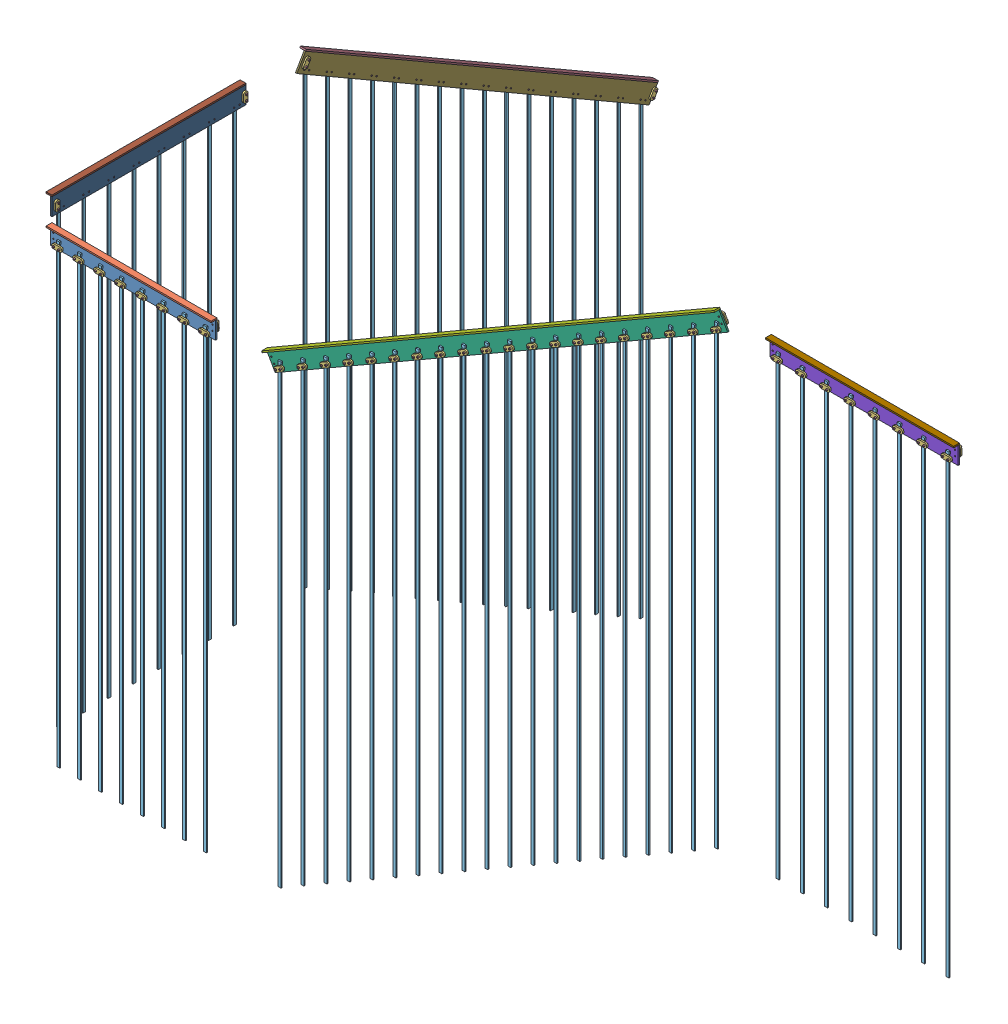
SolidWorks assembly Assem4.sldasm, configuration Default (file format 9000). Lengths in mm.
Overall size (4126.03 4076.18 2805.12).
297 component instances, 13 part files, 0 mates.
Components (placement in the parent):
- fs-ua-tier-assembly-1: fs-ua-tier-assembly.SLDASM [Default] at origin size (3991.35 3206.92 54.02)
  - fs-ua-left-mount-assembly-with-led-strips-1: fs-ua-left-mount-assembly-with-led-strips.SLDASM [Default] at origin size (723.9 2044.33 45.12)
    - fs-ua-left-mount-assembly-with-screws-1: fs-ua-left-mount-assembly-with-screws.SLDASM [Default] at origin size (723.9 82.55 45.12)
      - fs-ua-left-mount-assembly-1: fs-ua-left-mount-assembly.SLDASM [Default] at origin size (723.9 82.55 38.15)
        - fs-ua-left-mount-vertical-component-1: fs-ua-left-mount-vertical-component.SLDPRT [Default] at origin size (723.9 76.2 6.35)
        - fs-ua-left-mount-horizontal-component-1: fs-ua-left-mount-horizontal-component.SLDPRT [Default] at (361.95 76.2 12.7) size (723.9 6.35 25.4)
        - fs-clamp-1: fs-clamp.SLDPRT [Default] at (27.94 15.24 12.7326) size (44.45 20.32 6.35)
        - fs-clamp-2: fs-clamp.SLDPRT [Default] at (12.7 29.845 -12.7409) x (0 1 0) z (0 0 1) size (44.45 20.32 6.35)
        - fs-clamp-3: fs-clamp.SLDPRT [Default] at (711.2 29.845 -6.3972) x (0 1 0) z (0 0 -1) size (44.45 20.32 6.35)
        - fs-clamp-4: fs-clamp.SLDPRT [Default] at (119.9243 15.24 12.7326) size (44.45 20.32 6.35)
        - fs-clamp-5: fs-clamp.SLDPRT [Default] at (211.9086 15.24 12.7326) size (44.45 20.32 6.35)
        - fs-clamp-6: fs-clamp.SLDPRT [Default] at (303.893 15.24 12.7326) size (44.45 20.32 6.35)
        - fs-clamp-7: fs-clamp.SLDPRT [Default] at (395.8773 15.24 12.7326) size (44.45 20.32 6.35)
        - fs-clamp-8: fs-clamp.SLDPRT [Default] at (487.8616 15.24 12.7326) size (44.45 20.32 6.35)
        - fs-clamp-9: fs-clamp.SLDPRT [Default] at (579.8459 15.24 12.7326) size (44.45 20.32 6.35)
        - fs-clamp-10: fs-clamp.SLDPRT [Default] at (671.8303 15.24 12.7326) size (44.45 20.32 6.35)
      - socket head cap screw_ai-1: socket head cap screw_ai.sldprt [HX-SHCS 0.19-32x0.875x0.875-N] at (27.94 15.24 25.0524) x (0 0 -1) z (-0.570283 0.821448 0) size (27.05 7.94 7.94)
      - socket head cap screw_ai-2: socket head cap screw_ai.sldprt [HX-SHCS 0.19-32x0.875x0.875-N] at (711.2 53.975 -19.4006) x (0 0 1) z (-0.954871 -0.29702 0) size (27.05 7.94 7.94)
      - socket head cap screw_ai-3: socket head cap screw_ai.sldprt [HX-SHCS 0.19-32x0.875x0.875-N] at (711.2 29.845 -19.7235) x (0 0 1) z (-0.178736 -0.983897 0) size (27.05 7.94 7.94)
      - socket head cap screw_ai-4: socket head cap screw_ai.sldprt [HX-SHCS 0.19-32x0.875x0.875-N] at (12.7 53.975 -19.387) x (0 0 1) z (0.231262 0.972891 0) size (27.05 7.94 7.94)
      - socket head cap screw_ai-5: socket head cap screw_ai.sldprt [HX-SHCS 0.19-32x0.875x0.875-N] at (12.7 29.845 -19.6757) x (0 0 1) z (-0.841681 -0.539975 0) size (27.05 7.94 7.94)
      - socket head cap screw_ai-6: socket head cap screw_ai.sldprt [HX-SHCS 0.19-32x0.875x0.875-N] at (52.07 15.24 25.3347) x (0 0 -1) z (0.61191 -0.790927 0) size (27.05 7.94 7.94)
      - socket head cap screw_ai-7: socket head cap screw_ai.sldprt [HX-SHCS 0.19-32x0.875x0.875-N] at (119.9251 15.24 25.0524) x (0 0 -1) z (-0.570283 0.821448 0) size (27.05 7.94 7.94)
      - socket head cap screw_ai-8: socket head cap screw_ai.sldprt [HX-SHCS 0.19-32x0.875x0.875-N] at (211.9102 15.24 25.0524) x (0 0 -1) z (-0.570283 0.821448 0) size (27.05 7.94 7.94)
      - socket head cap screw_ai-9: socket head cap screw_ai.sldprt [HX-SHCS 0.19-32x0.875x0.875-N] at (303.8953 15.24 25.0524) x (0 0 -1) z (-0.570283 0.821448 0) size (27.05 7.94 7.94)
      - socket head cap screw_ai-10: socket head cap screw_ai.sldprt [HX-SHCS 0.19-32x0.875x0.875-N] at (395.8803 15.24 25.0524) x (0 0 -1) z (-0.570283 0.821448 0) size (27.05 7.94 7.94)
      - socket head cap screw_ai-11: socket head cap screw_ai.sldprt [HX-SHCS 0.19-32x0.875x0.875-N] at (487.8654 15.24 25.0524) x (0 0 -1) z (-0.570283 0.821448 0) size (27.05 7.94 7.94)
      - socket head cap screw_ai-12: socket head cap screw_ai.sldprt [HX-SHCS 0.19-32x0.875x0.875-N] at (579.8505 15.24 25.0524) x (0 0 -1) z (-0.570283 0.821448 0) size (27.05 7.94 7.94)
      - socket head cap screw_ai-13: socket head cap screw_ai.sldprt [HX-SHCS 0.19-32x0.875x0.875-N] at (671.8356 15.24 25.0524) x (0 0 -1) z (-0.570283 0.821448 0) size (27.05 7.94 7.94)
      - socket head cap screw_ai-14: socket head cap screw_ai.sldprt [HX-SHCS 0.19-32x0.875x0.875-N] at (144.0551 15.24 25.3347) x (0 0 -1) z (0.61191 -0.790927 0) size (27.05 7.94 7.94)
      - socket head cap screw_ai-15: socket head cap screw_ai.sldprt [HX-SHCS 0.19-32x0.875x0.875-N] at (236.0402 15.24 25.3347) x (0 0 -1) z (0.61191 -0.790927 0) size (27.05 7.94 7.94)
      - socket head cap screw_ai-16: socket head cap screw_ai.sldprt [HX-SHCS 0.19-32x0.875x0.875-N] at (328.0253 15.24 25.3347) x (0 0 -1) z (0.61191 -0.790927 0) size (27.05 7.94 7.94)
      - socket head cap screw_ai-17: socket head cap screw_ai.sldprt [HX-SHCS 0.19-32x0.875x0.875-N] at (420.0103 15.24 25.3347) x (0 0 -1) z (0.61191 -0.790927 0) size (27.05 7.94 7.94)
      - socket head cap screw_ai-18: socket head cap screw_ai.sldprt [HX-SHCS 0.19-32x0.875x0.875-N] at (511.9954 15.24 25.3347) x (0 0 -1) z (0.61191 -0.790927 0) size (27.05 7.94 7.94)
      - socket head cap screw_ai-19: socket head cap screw_ai.sldprt [HX-SHCS 0.19-32x0.875x0.875-N] at (603.9805 15.24 25.3347) x (0 0 -1) z (0.61191 -0.790927 0) size (27.05 7.94 7.94)
      - socket head cap screw_ai-20: socket head cap screw_ai.sldprt [HX-SHCS 0.19-32x0.875x0.875-N] at (695.9656 15.24 25.3347) x (0 0 -1) z (0.61191 -0.790927 0) size (27.05 7.94 7.94)
    - fs-led-strip-2: fs-led-strip.SLDPRT [Default] at (39.8281 32.6608 10.0075) size (14.29 2000 6.35)
    - fs-led-strip-3: fs-led-strip.SLDPRT [Default] at (131.8132 32.6608 10.0075) size (14.29 2000 6.35)
    - fs-led-strip-4: fs-led-strip.SLDPRT [Default] at (223.7983 32.6608 10.0075) size (14.29 2000 6.35)
    - fs-led-strip-5: fs-led-strip.SLDPRT [Default] at (315.7834 32.6608 10.0075) size (14.29 2000 6.35)
    - fs-led-strip-6: fs-led-strip.SLDPRT [Default] at (407.7685 32.6608 10.0075) size (14.29 2000 6.35)
    - fs-led-strip-7: fs-led-strip.SLDPRT [Default] at (499.7536 32.6608 10.0075) size (14.29 2000 6.35)
    - fs-led-strip-8: fs-led-strip.SLDPRT [Default] at (591.7386 32.6608 10.0075) size (14.29 2000 6.35)
    - fs-led-strip-9: fs-led-strip.SLDPRT [Default] at (683.7237 32.6608 10.0075) size (14.29 2000 6.35)
  - fs-ua-angled-mount-assembly-with-led-strips-1: fs-ua-angled-mount-assembly-with-led-strips.SLDASM [Default] at (1015.3176 66.3158 14.1159) size (2026.51 3158.55 44.16)
    - fs-led-strip-1: fs-led-strip.SLDPRT [Default] at origin size (14.29 2000 6.35)
    - fs-ua-angled-mount-assembly-with-screws-1: fs-ua-angled-mount-assembly-with-screws.SLDASM [Default] at (-24.8458 -53.5614 -9.8077) x (0.866025 0.5 0) z (0 0 1) size (2292.35 82.55 44.16)
      - fs-ua-angled-mount-assembly-1: fs-ua-angled-mount-assembly.SLDASM [Default] at origin size (2292.35 82.55 38)
        - fs-ua-angled-mount-vertical-component-1: fs-ua-angled-mount-vertical-component.SLDPRT [Default] at origin size (2292.35 76.2 6.35)
        - fs-ua-angled-mount-horizontal-component-1: fs-ua-angled-mount-horizontal-component.SLDPRT [Default] at (1146.175 76.2 12.7) size (2292.35 6.35 25.4)
        - fs-clamp-1: fs-clamp.SLDPRT [Default] at (27.94 15.24 12.8007) size (44.45 20.32 6.35)
        - fs-clamp-2: fs-clamp.SLDPRT [Default] at (144.3789 15.24 12.8007) size (44.45 20.32 6.35)
        - fs-clamp-3: fs-clamp.SLDPRT [Default] at (260.8179 15.24 12.8007) size (44.45 20.32 6.35)
        - fs-clamp-4: fs-clamp.SLDPRT [Default] at (377.2568 15.24 12.8007) size (44.45 20.32 6.35)
        - fs-clamp-5: fs-clamp.SLDPRT [Default] at (493.6957 15.24 12.8007) size (44.45 20.32 6.35)
        - fs-clamp-6: fs-clamp.SLDPRT [Default] at (610.1347 15.24 12.8007) size (44.45 20.32 6.35)
        - fs-clamp-7: fs-clamp.SLDPRT [Default] at (726.5736 15.24 12.8007) size (44.45 20.32 6.35)
        - fs-clamp-8: fs-clamp.SLDPRT [Default] at (843.0125 15.24 12.8007) size (44.45 20.32 6.35)
        - fs-clamp-9: fs-clamp.SLDPRT [Default] at (959.4515 15.24 12.8007) size (44.45 20.32 6.35)
        - fs-clamp-10: fs-clamp.SLDPRT [Default] at (1075.8904 15.24 12.8007) size (44.45 20.32 6.35)
        - fs-clamp-11: fs-clamp.SLDPRT [Default] at (1192.3293 15.24 12.8007) size (44.45 20.32 6.35)
        - fs-clamp-12: fs-clamp.SLDPRT [Default] at (1308.7683 15.24 12.8007) size (44.45 20.32 6.35)
        - fs-clamp-13: fs-clamp.SLDPRT [Default] at (1425.2072 15.24 12.8007) size (44.45 20.32 6.35)
        - fs-clamp-14: fs-clamp.SLDPRT [Default] at (1541.6461 15.24 12.8007) size (44.45 20.32 6.35)
        - fs-clamp-15: fs-clamp.SLDPRT [Default] at (1658.0851 15.24 12.8007) size (44.45 20.32 6.35)
        - fs-clamp-16: fs-clamp.SLDPRT [Default] at (1774.524 15.24 12.8007) size (44.45 20.32 6.35)
        - fs-clamp-17: fs-clamp.SLDPRT [Default] at (1890.9629 15.24 12.8007) size (44.45 20.32 6.35)
        - fs-clamp-18: fs-clamp.SLDPRT [Default] at (2007.4019 15.24 12.8007) size (44.45 20.32 6.35)
        - fs-clamp-19: fs-clamp.SLDPRT [Default] at (12.7 53.975 -12.5735) x (0 -1 0) z (0 0 1) size (44.45 20.32 6.35)
        - fs-clamp-20: fs-clamp.SLDPRT [Default] at (2279.65 29.845 -12.5985) x (0 1 0) z (0 0 1) size (44.45 20.32 6.35)
        - fs-clamp-21: fs-clamp.SLDPRT [Default] at (2123.8408 15.24 12.8007) size (44.45 20.32 6.35)
        - fs-clamp-22: fs-clamp.SLDPRT [Default] at (2240.2797 15.24 12.8007) size (44.45 20.32 6.35)
      - socket head cap screw_ai-1: socket head cap screw_ai.sldprt [HX-SHCS 0.19-32x0.875x0.875-N] at (27.94 15.24 25.0524) x (0 0 -1) z (-0.570283 0.821448 0) size (27.05 7.94 7.94)
      - socket head cap screw_ai-3: socket head cap screw_ai.sldprt [HX-SHCS 0.19-32x0.875x0.875-N] at (52.07 15.24 25.3347) x (0 0 -1) z (0.61191 -0.790927 0) size (27.05 7.94 7.94)
      - socket head cap screw_ai-4: socket head cap screw_ai.sldprt [HX-SHCS 0.19-32x0.875x0.875-N] at (12.7 29.845 -18.7638) x (0 0 1) z (-0.601781 -0.798661 0) size (27.05 7.94 7.94)
      - socket head cap screw_ai-5: socket head cap screw_ai.sldprt [HX-SHCS 0.19-32x0.875x0.875-N] at (12.7 53.975 -18.6513) x (0 0 1) z (0.101721 0.994813 0) size (27.05 7.94 7.94)
      - socket head cap screw_ai-6: socket head cap screw_ai.sldprt [HX-SHCS 0.19-32x0.875x0.875-N] at (2279.65 29.845 -18.7537) x (0 0 1) z (-0.220834 -0.975311 0) size (27.05 7.94 7.94)
      - socket head cap screw_ai-7: socket head cap screw_ai.sldprt [HX-SHCS 0.19-32x0.875x0.875-N] at (2279.65 53.975 -18.662) x (0 0 1) z (-0.85708 -0.515183 0) size (27.05 7.94 7.94)
      - socket head cap screw_ai-8: socket head cap screw_ai.sldprt [HX-SHCS 0.19-32x0.875x0.875-N] at (144.3789 15.24 25.0524) x (0 0 -1) z (-0.570283 0.821448 0) size (27.05 7.94 7.94)
      - socket head cap screw_ai-9: socket head cap screw_ai.sldprt [HX-SHCS 0.19-32x0.875x0.875-N] at (260.8179 15.24 25.0524) x (0 0 -1) z (-0.570283 0.821448 0) size (27.05 7.94 7.94)
      - socket head cap screw_ai-10: socket head cap screw_ai.sldprt [HX-SHCS 0.19-32x0.875x0.875-N] at (377.2568 15.24 25.0524) x (0 0 -1) z (-0.570283 0.821448 0) size (27.05 7.94 7.94)
      - socket head cap screw_ai-11: socket head cap screw_ai.sldprt [HX-SHCS 0.19-32x0.875x0.875-N] at (493.6957 15.24 25.0524) x (0 0 -1) z (-0.570283 0.821448 0) size (27.05 7.94 7.94)
      - socket head cap screw_ai-12: socket head cap screw_ai.sldprt [HX-SHCS 0.19-32x0.875x0.875-N] at (610.1347 15.24 25.0524) x (0 0 -1) z (-0.570283 0.821448 0) size (27.05 7.94 7.94)
      - socket head cap screw_ai-13: socket head cap screw_ai.sldprt [HX-SHCS 0.19-32x0.875x0.875-N] at (726.5736 15.24 25.0524) x (0 0 -1) z (-0.570283 0.821448 0) size (27.05 7.94 7.94)
      - socket head cap screw_ai-14: socket head cap screw_ai.sldprt [HX-SHCS 0.19-32x0.875x0.875-N] at (843.0125 15.24 25.0524) x (0 0 -1) z (-0.570283 0.821448 0) size (27.05 7.94 7.94)
      - socket head cap screw_ai-15: socket head cap screw_ai.sldprt [HX-SHCS 0.19-32x0.875x0.875-N] at (959.4515 15.24 25.0524) x (0 0 -1) z (-0.570283 0.821448 0) size (27.05 7.94 7.94)
      - socket head cap screw_ai-16: socket head cap screw_ai.sldprt [HX-SHCS 0.19-32x0.875x0.875-N] at (1075.8904 15.24 25.0524) x (0 0 -1) z (-0.570283 0.821448 0) size (27.05 7.94 7.94)
      - socket head cap screw_ai-17: socket head cap screw_ai.sldprt [HX-SHCS 0.19-32x0.875x0.875-N] at (1192.3293 15.24 25.0524) x (0 0 -1) z (-0.570283 0.821448 0) size (27.05 7.94 7.94)
      - socket head cap screw_ai-18: socket head cap screw_ai.sldprt [HX-SHCS 0.19-32x0.875x0.875-N] at (1308.7683 15.24 25.0524) x (0 0 -1) z (-0.570283 0.821448 0) size (27.05 7.94 7.94)
      - socket head cap screw_ai-19: socket head cap screw_ai.sldprt [HX-SHCS 0.19-32x0.875x0.875-N] at (1425.2072 15.24 25.0524) x (0 0 -1) z (-0.570283 0.821448 0) size (27.05 7.94 7.94)
      - socket head cap screw_ai-20: socket head cap screw_ai.sldprt [HX-SHCS 0.19-32x0.875x0.875-N] at (1541.6461 15.24 25.0524) x (0 0 -1) z (-0.570283 0.821448 0) size (27.05 7.94 7.94)
      - socket head cap screw_ai-21: socket head cap screw_ai.sldprt [HX-SHCS 0.19-32x0.875x0.875-N] at (1658.0851 15.24 25.0524) x (0 0 -1) z (-0.570283 0.821448 0) size (27.05 7.94 7.94)
      - socket head cap screw_ai-22: socket head cap screw_ai.sldprt [HX-SHCS 0.19-32x0.875x0.875-N] at (1774.524 15.24 25.0524) x (0 0 -1) z (-0.570283 0.821448 0) size (27.05 7.94 7.94)
      - socket head cap screw_ai-23: socket head cap screw_ai.sldprt [HX-SHCS 0.19-32x0.875x0.875-N] at (1890.9629 15.24 25.0524) x (0 0 -1) z (-0.570283 0.821448 0) size (27.05 7.94 7.94)
      - socket head cap screw_ai-24: socket head cap screw_ai.sldprt [HX-SHCS 0.19-32x0.875x0.875-N] at (2007.4019 15.24 25.0524) x (0 0 -1) z (-0.570283 0.821448 0) size (27.05 7.94 7.94)
      - socket head cap screw_ai-25: socket head cap screw_ai.sldprt [HX-SHCS 0.19-32x0.875x0.875-N] at (168.4835 15.24 25.3347) x (0 0 -1) z (0.61191 -0.790927 0) size (27.05 7.94 7.94)
      - socket head cap screw_ai-26: socket head cap screw_ai.sldprt [HX-SHCS 0.19-32x0.875x0.875-N] at (284.8971 15.24 25.3347) x (0 0 -1) z (0.61191 -0.790927 0) size (27.05 7.94 7.94)
      - socket head cap screw_ai-27: socket head cap screw_ai.sldprt [HX-SHCS 0.19-32x0.875x0.875-N] at (401.3106 15.24 25.3347) x (0 0 -1) z (0.61191 -0.790927 0) size (27.05 7.94 7.94)
      - socket head cap screw_ai-28: socket head cap screw_ai.sldprt [HX-SHCS 0.19-32x0.875x0.875-N] at (517.7241 15.24 25.3347) x (0 0 -1) z (0.61191 -0.790927 0) size (27.05 7.94 7.94)
      - socket head cap screw_ai-29: socket head cap screw_ai.sldprt [HX-SHCS 0.19-32x0.875x0.875-N] at (634.1377 15.24 25.3347) x (0 0 -1) z (0.61191 -0.790927 0) size (27.05 7.94 7.94)
      - socket head cap screw_ai-30: socket head cap screw_ai.sldprt [HX-SHCS 0.19-32x0.875x0.875-N] at (750.5512 15.24 25.3347) x (0 0 -1) z (0.61191 -0.790927 0) size (27.05 7.94 7.94)
      - socket head cap screw_ai-31: socket head cap screw_ai.sldprt [HX-SHCS 0.19-32x0.875x0.875-N] at (866.9647 15.24 25.3347) x (0 0 -1) z (0.61191 -0.790927 0) size (27.05 7.94 7.94)
      - socket head cap screw_ai-32: socket head cap screw_ai.sldprt [HX-SHCS 0.19-32x0.875x0.875-N] at (983.3783 15.24 25.3347) x (0 0 -1) z (0.61191 -0.790927 0) size (27.05 7.94 7.94)
      - socket head cap screw_ai-33: socket head cap screw_ai.sldprt [HX-SHCS 0.19-32x0.875x0.875-N] at (1099.7918 15.24 25.3347) x (0 0 -1) z (0.61191 -0.790927 0) size (27.05 7.94 7.94)
      - socket head cap screw_ai-34: socket head cap screw_ai.sldprt [HX-SHCS 0.19-32x0.875x0.875-N] at (1216.2053 15.24 25.3347) x (0 0 -1) z (0.61191 -0.790927 0) size (27.05 7.94 7.94)
      - socket head cap screw_ai-35: socket head cap screw_ai.sldprt [HX-SHCS 0.19-32x0.875x0.875-N] at (1332.6189 15.24 25.3347) x (0 0 -1) z (0.61191 -0.790927 0) size (27.05 7.94 7.94)
      - socket head cap screw_ai-36: socket head cap screw_ai.sldprt [HX-SHCS 0.19-32x0.875x0.875-N] at (1449.0324 15.24 25.3347) x (0 0 -1) z (0.61191 -0.790927 0) size (27.05 7.94 7.94)
      - socket head cap screw_ai-37: socket head cap screw_ai.sldprt [HX-SHCS 0.19-32x0.875x0.875-N] at (1565.4459 15.24 25.3347) x (0 0 -1) z (0.61191 -0.790927 0) size (27.05 7.94 7.94)
      - socket head cap screw_ai-38: socket head cap screw_ai.sldprt [HX-SHCS 0.19-32x0.875x0.875-N] at (1681.8595 15.24 25.3347) x (0 0 -1) z (0.61191 -0.790927 0) size (27.05 7.94 7.94)
      - socket head cap screw_ai-39: socket head cap screw_ai.sldprt [HX-SHCS 0.19-32x0.875x0.875-N] at (1798.273 15.24 25.3347) x (0 0 -1) z (0.61191 -0.790927 0) size (27.05 7.94 7.94)
      - socket head cap screw_ai-40: socket head cap screw_ai.sldprt [HX-SHCS 0.19-32x0.875x0.875-N] at (1914.6865 15.24 25.3347) x (0 0 -1) z (0.61191 -0.790927 0) size (27.05 7.94 7.94)
      - socket head cap screw_ai-41: socket head cap screw_ai.sldprt [HX-SHCS 0.19-32x0.875x0.875-N] at (2031.1001 15.24 25.3347) x (0 0 -1) z (0.61191 -0.790927 0) size (27.05 7.94 7.94)
      - socket head cap screw_ai-42: socket head cap screw_ai.sldprt [HX-SHCS 0.19-32x0.875x0.875-N] at (2123.8408 15.24 25.0524) x (0 0 -1) z (-0.570283 0.821448 0) size (27.05 7.94 7.94)
      - socket head cap screw_ai-43: socket head cap screw_ai.sldprt [HX-SHCS 0.19-32x0.875x0.875-N] at (2240.2797 15.24 25.0524) x (0 0 -1) z (-0.570283 0.821448 0) size (27.05 7.94 7.94)
      - socket head cap screw_ai-44: socket head cap screw_ai.sldprt [HX-SHCS 0.19-32x0.875x0.875-N] at (2147.5136 15.24 25.3347) x (0 0 -1) z (0.61191 -0.790927 0) size (27.05 7.94 7.94)
      - socket head cap screw_ai-45: socket head cap screw_ai.sldprt [HX-SHCS 0.19-32x0.875x0.875-N] at (2263.9271 15.24 25.3347) x (0 0 -1) z (0.61191 -0.790927 0) size (27.05 7.94 7.94)
    - fs-led-strip-2: fs-led-strip.SLDPRT [Default] at (100.8391 58.2195 0) size (14.29 2000 6.35)
    - fs-led-strip-3: fs-led-strip.SLDPRT [Default] at (201.6781 116.4389 0) size (14.29 2000 6.35)
    - fs-led-strip-4: fs-led-strip.SLDPRT [Default] at (302.5172 174.6584 0) size (14.29 2000 6.35)
    - fs-led-strip-5: fs-led-strip.SLDPRT [Default] at (403.3563 232.8779 0) size (14.29 2000 6.35)
    - fs-led-strip-6: fs-led-strip.SLDPRT [Default] at (504.1954 291.0973 0) size (14.29 2000 6.35)
    - fs-led-strip-7: fs-led-strip.SLDPRT [Default] at (605.0344 349.3168 0) size (14.29 2000 6.35)
    - fs-led-strip-8: fs-led-strip.SLDPRT [Default] at (705.8735 407.5363 0) size (14.29 2000 6.35)
    - fs-led-strip-9: fs-led-strip.SLDPRT [Default] at (806.7126 465.7557 0) size (14.29 2000 6.35)
    - fs-led-strip-10: fs-led-strip.SLDPRT [Default] at (907.5517 523.9752 0) size (14.29 2000 6.35)
    - fs-led-strip-11: fs-led-strip.SLDPRT [Default] at (1008.3907 582.1947 0) size (14.29 2000 6.35)
    - fs-led-strip-12: fs-led-strip.SLDPRT [Default] at (1109.2298 640.4141 0) size (14.29 2000 6.35)
    - fs-led-strip-13: fs-led-strip.SLDPRT [Default] at (1210.0689 698.6336 0) size (14.29 2000 6.35)
    - fs-led-strip-14: fs-led-strip.SLDPRT [Default] at (1310.908 756.8531 0) size (14.29 2000 6.35)
    - fs-led-strip-15: fs-led-strip.SLDPRT [Default] at (1411.747 815.0725 0) size (14.29 2000 6.35)
    - fs-led-strip-16: fs-led-strip.SLDPRT [Default] at (1512.5861 873.292 0) size (14.29 2000 6.35)
    - fs-led-strip-17: fs-led-strip.SLDPRT [Default] at (1613.4252 931.5115 0) size (14.29 2000 6.35)
    - fs-led-strip-18: fs-led-strip.SLDPRT [Default] at (1714.2643 989.7309 0) size (14.29 2000 6.35)
    - fs-led-strip-19: fs-led-strip.SLDPRT [Default] at (1815.1033 1047.9504 0) size (14.29 2000 6.35)
    - fs-led-strip-20: fs-led-strip.SLDPRT [Default] at (1915.9424 1106.1699 0) size (14.29 2000 6.35)
  - fs-ua-right-mount-assembly-with-led-strips-1: fs-ua-right-mount-assembly-with-led-strips.SLDASM [Default] at (3165.8534 1162.5883 8.8963) size (825.5 2044.33 45.12)
    - fs-ua-right-mount-assembly-with-screws-1: fs-ua-right-mount-assembly-with-screws.SLDASM [Default] at origin size (825.5 82.55 45.12)
      - fs-ua-right-mount-assembly-1: fs-ua-right-mount-assembly.SLDASM [Default] at origin size (825.5 82.55 38.15)
        - fs-ua-right-mount-vertical-component-1: fs-ua-right-mount-vertical-component.SLDPRT [Default] at origin size (825.5 76.2 6.35)
        - fs-ua-right-mount-horizontal-component-1: fs-ua-right-mount-horizontal-component.SLDPRT [Default] at (412.75 76.2 12.7) size (825.5 6.35 25.4)
        - fs-clamp-1: fs-clamp.SLDPRT [Default] at (27.94 15.24 12.7326) size (44.45 20.32 6.35)
        - fs-clamp-11: fs-clamp.SLDPRT [Default] at (12.7 29.845 -12.7409) x (0 1 0) z (0 0 1) size (44.45 20.32 6.35)
        - fs-clamp-12: fs-clamp.SLDPRT [Default] at (812.8 29.845 -6.3972) x (0 1 0) z (0 0 -1) size (44.45 20.32 6.35)
        - fs-clamp-4: fs-clamp.SLDPRT [Default] at (134.366 15.24 12.7326) size (44.45 20.32 6.35)
        - fs-clamp-5: fs-clamp.SLDPRT [Default] at (240.792 15.24 12.7326) size (44.45 20.32 6.35)
        - fs-clamp-6: fs-clamp.SLDPRT [Default] at (347.218 15.24 12.7326) size (44.45 20.32 6.35)
        - fs-clamp-7: fs-clamp.SLDPRT [Default] at (453.644 15.24 12.7326) size (44.45 20.32 6.35)
        - fs-clamp-8: fs-clamp.SLDPRT [Default] at (560.07 15.24 12.7326) size (44.45 20.32 6.35)
        - fs-clamp-9: fs-clamp.SLDPRT [Default] at (666.496 15.24 12.7326) size (44.45 20.32 6.35)
        - fs-clamp-10: fs-clamp.SLDPRT [Default] at (772.922 15.24 12.7326) size (44.45 20.32 6.35)
      - socket head cap screw_ai-1: socket head cap screw_ai.sldprt [HX-SHCS 0.19-32x0.875x0.875-N] at (52.07 15.24 25.3347) x (0 0 -1) z (0.61191 -0.790927 0) size (27.05 7.94 7.94)
      - socket head cap screw_ai-2: socket head cap screw_ai.sldprt [HX-SHCS 0.19-32x0.875x0.875-N] at (12.7 29.845 -19.6757) x (0 0 1) z (-0.841681 -0.539975 0) size (27.05 7.94 7.94)
      - socket head cap screw_ai-3: socket head cap screw_ai.sldprt [HX-SHCS 0.19-32x0.875x0.875-N] at (12.7 53.975 -19.387) x (0 0 1) z (0.231262 0.972891 0) size (27.05 7.94 7.94)
      - socket head cap screw_ai-4: socket head cap screw_ai.sldprt [HX-SHCS 0.19-32x0.875x0.875-N] at (812.8 29.845 -19.7235) x (0 0 1) z (-0.178736 -0.983897 0) size (27.05 7.94 7.94)
      - socket head cap screw_ai-5: socket head cap screw_ai.sldprt [HX-SHCS 0.19-32x0.875x0.875-N] at (812.8 53.975 -19.4006) x (0 0 1) z (-0.954871 -0.29702 0) size (27.05 7.94 7.94)
      - socket head cap screw_ai-6: socket head cap screw_ai.sldprt [HX-SHCS 0.19-32x0.875x0.875-N] at (27.94 15.24 25.0524) x (0 0 -1) z (-0.570283 0.821448 0) size (27.05 7.94 7.94)
      - socket head cap screw_ai-7: socket head cap screw_ai.sldprt [HX-SHCS 0.19-32x0.875x0.875-N] at (134.366 15.24 25.0524) x (0 0 -1) z (-0.570283 0.821448 0) size (27.05 7.94 7.94)
      - socket head cap screw_ai-8: socket head cap screw_ai.sldprt [HX-SHCS 0.19-32x0.875x0.875-N] at (240.792 15.24 25.0524) x (0 0 -1) z (-0.570283 0.821448 0) size (27.05 7.94 7.94)
      - socket head cap screw_ai-9: socket head cap screw_ai.sldprt [HX-SHCS 0.19-32x0.875x0.875-N] at (347.218 15.24 25.0524) x (0 0 -1) z (-0.570283 0.821448 0) size (27.05 7.94 7.94)
      - socket head cap screw_ai-10: socket head cap screw_ai.sldprt [HX-SHCS 0.19-32x0.875x0.875-N] at (453.644 15.24 25.0524) x (0 0 -1) z (-0.570283 0.821448 0) size (27.05 7.94 7.94)
      - socket head cap screw_ai-11: socket head cap screw_ai.sldprt [HX-SHCS 0.19-32x0.875x0.875-N] at (560.07 15.24 25.0524) x (0 0 -1) z (-0.570283 0.821448 0) size (27.05 7.94 7.94)
      - socket head cap screw_ai-12: socket head cap screw_ai.sldprt [HX-SHCS 0.19-32x0.875x0.875-N] at (666.496 15.24 25.0524) x (0 0 -1) z (-0.570283 0.821448 0) size (27.05 7.94 7.94)
      - socket head cap screw_ai-13: socket head cap screw_ai.sldprt [HX-SHCS 0.19-32x0.875x0.875-N] at (772.922 15.24 25.0524) x (0 0 -1) z (-0.570283 0.821448 0) size (27.05 7.94 7.94)
      - socket head cap screw_ai-14: socket head cap screw_ai.sldprt [HX-SHCS 0.19-32x0.875x0.875-N] at (158.496 15.24 25.3347) x (0 0 -1) z (0.61191 -0.790927 0) size (27.05 7.94 7.94)
      - socket head cap screw_ai-15: socket head cap screw_ai.sldprt [HX-SHCS 0.19-32x0.875x0.875-N] at (264.922 15.24 25.3347) x (0 0 -1) z (0.61191 -0.790927 0) size (27.05 7.94 7.94)
      - socket head cap screw_ai-16: socket head cap screw_ai.sldprt [HX-SHCS 0.19-32x0.875x0.875-N] at (371.348 15.24 25.3347) x (0 0 -1) z (0.61191 -0.790927 0) size (27.05 7.94 7.94)
      - socket head cap screw_ai-17: socket head cap screw_ai.sldprt [HX-SHCS 0.19-32x0.875x0.875-N] at (477.774 15.24 25.3347) x (0 0 -1) z (0.61191 -0.790927 0) size (27.05 7.94 7.94)
      - socket head cap screw_ai-18: socket head cap screw_ai.sldprt [HX-SHCS 0.19-32x0.875x0.875-N] at (584.2 15.24 25.3347) x (0 0 -1) z (0.61191 -0.790927 0) size (27.05 7.94 7.94)
      - socket head cap screw_ai-19: socket head cap screw_ai.sldprt [HX-SHCS 0.19-32x0.875x0.875-N] at (690.626 15.24 25.3347) x (0 0 -1) z (0.61191 -0.790927 0) size (27.05 7.94 7.94)
      - socket head cap screw_ai-20: socket head cap screw_ai.sldprt [HX-SHCS 0.19-32x0.875x0.875-N] at (797.052 15.24 25.3347) x (0 0 -1) z (0.61191 -0.790927 0) size (27.05 7.94 7.94)
    - fs-led-strip-1: fs-led-strip.SLDPRT [Default] at (39.8281 32.6608 10.0075) size (14.29 2000 6.35)
    - fs-led-strip-2: fs-led-strip.SLDPRT [Default] at (146.2541 32.6608 10.0075) size (14.29 2000 6.35)
    - fs-led-strip-3: fs-led-strip.SLDPRT [Default] at (252.6801 32.6608 10.0075) size (14.29 2000 6.35)
    - fs-led-strip-4: fs-led-strip.SLDPRT [Default] at (359.1061 32.6608 10.0075) size (14.29 2000 6.35)
    - fs-led-strip-5: fs-led-strip.SLDPRT [Default] at (465.5321 32.6608 10.0075) size (14.29 2000 6.35)
    - fs-led-strip-6: fs-led-strip.SLDPRT [Default] at (571.9581 32.6608 10.0075) size (14.29 2000 6.35)
    - fs-led-strip-7: fs-led-strip.SLDPRT [Default] at (678.3841 32.6608 10.0075) size (14.29 2000 6.35)
    - fs-led-strip-8: fs-led-strip.SLDPRT [Default] at (784.8101 32.6608 10.0075) size (14.29 2000 6.35)
- fs-bs-tier-assembly-1: fs-bs-tier-assembly.SLDASM [Default] at (-104.9693 -0.4492 -955.7376) x (0 0 1) z (-1 0 0) size (2665.99 2913.15 49.43)
  - fs-bs-right-mount-assembly-with-led-strips-1: fs-bs-right-mount-assembly-with-led-strips.SLDASM [Default] at origin size (850.9 2044.33 45.12)
    - fs-bs-right-mount-assembly-with-screws-1: fs-bs-right-mount-assembly-with-screws.SLDASM [Default] at origin size (850.9 82.55 45.12)
      - fs-bs-right-mount-assembly-1: fs-bs-right-mount-assembly.SLDASM [Default] at origin size (850.9 82.55 38.15)
        - fs-bs-right-mount-vertical-component-1: fs-bs-right-mount-vertical-component.SLDPRT [Default] at origin size (850.9 76.2 6.35)
        - fs-bs-right-mount-horizontal-component-1: fs-bs-right-mount-horizontal-component.SLDPRT [Default] at (425.45 76.2 12.7) size (850.9 6.35 25.4)
        - fs-clamp-1: fs-clamp.SLDPRT [Default] at (27.94 15.24 12.7326) size (44.45 20.32 6.35)
        - fs-clamp-11: fs-clamp.SLDPRT [Default] at (12.7 29.845 -12.7409) x (0 1 0) z (0 0 1) size (44.45 20.32 6.35)
        - fs-clamp-12: fs-clamp.SLDPRT [Default] at (838.2 29.845 -6.3972) x (0 1 0) z (0 0 -1) size (44.45 20.32 6.35)
        - fs-clamp-4: fs-clamp.SLDPRT [Default] at (138.176 15.24 12.7326) size (44.45 20.32 6.35)
        - fs-clamp-5: fs-clamp.SLDPRT [Default] at (248.412 15.24 12.7326) size (44.45 20.32 6.35)
        - fs-clamp-6: fs-clamp.SLDPRT [Default] at (358.648 15.24 12.7326) size (44.45 20.32 6.35)
        - fs-clamp-7: fs-clamp.SLDPRT [Default] at (468.884 15.24 12.7326) size (44.45 20.32 6.35)
        - fs-clamp-8: fs-clamp.SLDPRT [Default] at (579.12 15.24 12.7326) size (44.45 20.32 6.35)
        - fs-clamp-9: fs-clamp.SLDPRT [Default] at (689.356 15.24 12.7326) size (44.45 20.32 6.35)
        - fs-clamp-10: fs-clamp.SLDPRT [Default] at (799.592 15.24 12.7326) size (44.45 20.32 6.35)
      - socket head cap screw_ai-1: socket head cap screw_ai.sldprt [HX-SHCS 0.19-32x0.875x0.875-N] at (52.07 15.24 25.3347) x (0 0 -1) z (0.61191 -0.790927 0) size (27.05 7.94 7.94)
      - socket head cap screw_ai-2: socket head cap screw_ai.sldprt [HX-SHCS 0.19-32x0.875x0.875-N] at (12.7 29.845 -19.6757) x (0 0 1) z (-0.841681 -0.539975 0) size (27.05 7.94 7.94)
      - socket head cap screw_ai-3: socket head cap screw_ai.sldprt [HX-SHCS 0.19-32x0.875x0.875-N] at (12.7 53.975 -19.387) x (0 0 1) z (0.231262 0.972891 0) size (27.05 7.94 7.94)
      - socket head cap screw_ai-4: socket head cap screw_ai.sldprt [HX-SHCS 0.19-32x0.875x0.875-N] at (838.2 29.845 -19.7235) x (0 0 1) z (-0.178736 -0.983897 0) size (27.05 7.94 7.94)
      - socket head cap screw_ai-5: socket head cap screw_ai.sldprt [HX-SHCS 0.19-32x0.875x0.875-N] at (838.2 53.975 -19.4006) x (0 0 1) z (-0.954871 -0.29702 0) size (27.05 7.94 7.94)
      - socket head cap screw_ai-6: socket head cap screw_ai.sldprt [HX-SHCS 0.19-32x0.875x0.875-N] at (27.94 15.24 25.0524) x (0 0 -1) z (-0.570283 0.821448 0) size (27.05 7.94 7.94)
      - socket head cap screw_ai-7: socket head cap screw_ai.sldprt [HX-SHCS 0.19-32x0.875x0.875-N] at (138.176 15.24 25.0524) x (0 0 -1) z (-0.570283 0.821448 0) size (27.05 7.94 7.94)
      - socket head cap screw_ai-8: socket head cap screw_ai.sldprt [HX-SHCS 0.19-32x0.875x0.875-N] at (248.412 15.24 25.0524) x (0 0 -1) z (-0.570283 0.821448 0) size (27.05 7.94 7.94)
      - socket head cap screw_ai-9: socket head cap screw_ai.sldprt [HX-SHCS 0.19-32x0.875x0.875-N] at (358.648 15.24 25.0524) x (0 0 -1) z (-0.570283 0.821448 0) size (27.05 7.94 7.94)
      - socket head cap screw_ai-10: socket head cap screw_ai.sldprt [HX-SHCS 0.19-32x0.875x0.875-N] at (468.884 15.24 25.0524) x (0 0 -1) z (-0.570283 0.821448 0) size (27.05 7.94 7.94)
      - socket head cap screw_ai-11: socket head cap screw_ai.sldprt [HX-SHCS 0.19-32x0.875x0.875-N] at (579.12 15.24 25.0524) x (0 0 -1) z (-0.570283 0.821448 0) size (27.05 7.94 7.94)
      - socket head cap screw_ai-12: socket head cap screw_ai.sldprt [HX-SHCS 0.19-32x0.875x0.875-N] at (689.356 15.24 25.0524) x (0 0 -1) z (-0.570283 0.821448 0) size (27.05 7.94 7.94)
      - socket head cap screw_ai-13: socket head cap screw_ai.sldprt [HX-SHCS 0.19-32x0.875x0.875-N] at (799.592 15.24 25.0524) x (0 0 -1) z (-0.570283 0.821448 0) size (27.05 7.94 7.94)
      - socket head cap screw_ai-14: socket head cap screw_ai.sldprt [HX-SHCS 0.19-32x0.875x0.875-N] at (162.306 15.24 25.3347) x (0 0 -1) z (0.61191 -0.790927 0) size (27.05 7.94 7.94)
      - socket head cap screw_ai-15: socket head cap screw_ai.sldprt [HX-SHCS 0.19-32x0.875x0.875-N] at (272.542 15.24 25.3347) x (0 0 -1) z (0.61191 -0.790927 0) size (27.05 7.94 7.94)
      - socket head cap screw_ai-16: socket head cap screw_ai.sldprt [HX-SHCS 0.19-32x0.875x0.875-N] at (382.778 15.24 25.3347) x (0 0 -1) z (0.61191 -0.790927 0) size (27.05 7.94 7.94)
      - socket head cap screw_ai-17: socket head cap screw_ai.sldprt [HX-SHCS 0.19-32x0.875x0.875-N] at (493.014 15.24 25.3347) x (0 0 -1) z (0.61191 -0.790927 0) size (27.05 7.94 7.94)
      - socket head cap screw_ai-18: socket head cap screw_ai.sldprt [HX-SHCS 0.19-32x0.875x0.875-N] at (603.25 15.24 25.3347) x (0 0 -1) z (0.61191 -0.790927 0) size (27.05 7.94 7.94)
      - socket head cap screw_ai-19: socket head cap screw_ai.sldprt [HX-SHCS 0.19-32x0.875x0.875-N] at (713.486 15.24 25.3347) x (0 0 -1) z (0.61191 -0.790927 0) size (27.05 7.94 7.94)
      - socket head cap screw_ai-20: socket head cap screw_ai.sldprt [HX-SHCS 0.19-32x0.875x0.875-N] at (823.722 15.24 25.3347) x (0 0 -1) z (0.61191 -0.790927 0) size (27.05 7.94 7.94)
    - fs-led-strip-1: fs-led-strip.SLDPRT [Default] at (39.8281 32.6608 10.0075) size (14.29 2000 6.35)
    - fs-led-strip-2: fs-led-strip.SLDPRT [Default] at (150.0641 32.6608 10.0075) size (14.29 2000 6.35)
    - fs-led-strip-3: fs-led-strip.SLDPRT [Default] at (260.3001 32.6608 10.0075) size (14.29 2000 6.35)
    - fs-led-strip-4: fs-led-strip.SLDPRT [Default] at (370.5361 32.6608 10.0075) size (14.29 2000 6.35)
    - fs-led-strip-5: fs-led-strip.SLDPRT [Default] at (480.7721 32.6608 10.0075) size (14.29 2000 6.35)
    - fs-led-strip-6: fs-led-strip.SLDPRT [Default] at (591.0081 32.6608 10.0075) size (14.29 2000 6.35)
    - fs-led-strip-7: fs-led-strip.SLDPRT [Default] at (701.2441 32.6608 10.0075) size (14.29 2000 6.35)
    - fs-led-strip-8: fs-led-strip.SLDPRT [Default] at (811.4801 32.6608 10.0075) size (14.29 2000 6.35)
  - fs-bs-angled-mount-assembly-with-led-strips-1: fs-bs-angled-mount-assembly-with-led-strips.SLDASM [Default] at (-1748.9685 -836.1518 14.1159) size (1586.57 2904.55 44.16)
    - fs-led-strip-1: fs-led-strip.SLDPRT [Default] at origin size (14.29 2000 6.35)
    - fs-bs-angled-mount-assembly-with-screws-1: fs-bs-angled-mount-assembly-with-screws.SLDASM [Default] at (-24.8458 -53.5614 -9.8077) x (0.866025 0.5 0) z (0 0 1) size (1784.35 82.55 44.16)
      - fs-bs-angled-mount-assembly-1: fs-bs-angled-mount-assembly.SLDASM [Default] at origin size (1784.35 82.55 38)
        - fs-bs-angled-mount-vertical-component-1: fs-bs-angled-mount-vertical-component.SLDPRT [Default] at origin size (1784.35 76.2 6.35)
        - fs-bs-angled-mount-horizontal-component-1: fs-bs-angled-mount-horizontal-component.SLDPRT [Default] at (892.175 76.2 12.7) size (1784.35 6.35 25.4)
        - fs-clamp-1: fs-clamp.SLDPRT [Default] at (27.94 15.24 12.8007) size (44.45 20.32 6.35)
        - fs-clamp-2: fs-clamp.SLDPRT [Default] at (141.478 15.24 12.8007) size (44.45 20.32 6.35)
        - fs-clamp-3: fs-clamp.SLDPRT [Default] at (255.016 15.24 12.8007) size (44.45 20.32 6.35)
        - fs-clamp-4: fs-clamp.SLDPRT [Default] at (368.554 15.24 12.8007) size (44.45 20.32 6.35)
        - fs-clamp-5: fs-clamp.SLDPRT [Default] at (482.092 15.24 12.8007) size (44.45 20.32 6.35)
        - fs-clamp-6: fs-clamp.SLDPRT [Default] at (595.63 15.24 12.8007) size (44.45 20.32 6.35)
        - fs-clamp-7: fs-clamp.SLDPRT [Default] at (709.168 15.24 12.8007) size (44.45 20.32 6.35)
        - fs-clamp-8: fs-clamp.SLDPRT [Default] at (822.706 15.24 12.8007) size (44.45 20.32 6.35)
        - fs-clamp-9: fs-clamp.SLDPRT [Default] at (936.244 15.24 12.8007) size (44.45 20.32 6.35)
        - fs-clamp-10: fs-clamp.SLDPRT [Default] at (1049.782 15.24 12.8007) size (44.45 20.32 6.35)
        - fs-clamp-11: fs-clamp.SLDPRT [Default] at (1163.32 15.24 12.8007) size (44.45 20.32 6.35)
        - fs-clamp-12: fs-clamp.SLDPRT [Default] at (1276.858 15.24 12.8007) size (44.45 20.32 6.35)
        - fs-clamp-13: fs-clamp.SLDPRT [Default] at (1390.396 15.24 12.8007) size (44.45 20.32 6.35)
        - fs-clamp-14: fs-clamp.SLDPRT [Default] at (1503.934 15.24 12.8007) size (44.45 20.32 6.35)
        - fs-clamp-15: fs-clamp.SLDPRT [Default] at (1617.472 15.24 12.8007) size (44.45 20.32 6.35)
        - fs-clamp-16: fs-clamp.SLDPRT [Default] at (1731.01 15.24 12.8007) size (44.45 20.32 6.35)
        - fs-clamp-19: fs-clamp.SLDPRT [Default] at (12.7 53.975 -12.5735) x (0 -1 0) z (0 0 1) size (44.45 20.32 6.35)
        - fs-clamp-20: fs-clamp.SLDPRT [Default] at (1771.65 29.845 -12.5985) x (0 1 0) z (0 0 1) size (44.45 20.32 6.35)
      - socket head cap screw_ai-1: socket head cap screw_ai.sldprt [HX-SHCS 0.19-32x0.875x0.875-N] at (27.94 15.24 25.0524) x (0 0 -1) z (-0.570283 0.821448 0) size (27.05 7.94 7.94)
      - socket head cap screw_ai-3: socket head cap screw_ai.sldprt [HX-SHCS 0.19-32x0.875x0.875-N] at (52.07 15.24 25.3347) x (0 0 -1) z (0.61191 -0.790927 0) size (27.05 7.94 7.94)
      - socket head cap screw_ai-4: socket head cap screw_ai.sldprt [HX-SHCS 0.19-32x0.875x0.875-N] at (12.7 29.845 -18.7638) x (0 0 1) z (-0.601781 -0.798661 0) size (27.05 7.94 7.94)
      - socket head cap screw_ai-5: socket head cap screw_ai.sldprt [HX-SHCS 0.19-32x0.875x0.875-N] at (12.7 53.975 -18.6513) x (0 0 1) z (0.101721 0.994813 0) size (27.05 7.94 7.94)
      - socket head cap screw_ai-6: socket head cap screw_ai.sldprt [HX-SHCS 0.19-32x0.875x0.875-N] at (1771.65 29.845 -18.7537) x (0 0 1) z (-0.220834 -0.975311 0) size (27.05 7.94 7.94)
      - socket head cap screw_ai-7: socket head cap screw_ai.sldprt [HX-SHCS 0.19-32x0.875x0.875-N] at (1771.65 53.975 -18.662) x (0 0 1) z (-0.85708 -0.515183 0) size (27.05 7.94 7.94)
      - socket head cap screw_ai-8: socket head cap screw_ai.sldprt [HX-SHCS 0.19-32x0.875x0.875-N] at (141.478 15.24 25.0524) x (0 0 -1) z (-0.570283 0.821448 0) size (27.05 7.94 7.94)
      - socket head cap screw_ai-9: socket head cap screw_ai.sldprt [HX-SHCS 0.19-32x0.875x0.875-N] at (255.016 15.24 25.0524) x (0 0 -1) z (-0.570283 0.821448 0) size (27.05 7.94 7.94)
      - socket head cap screw_ai-10: socket head cap screw_ai.sldprt [HX-SHCS 0.19-32x0.875x0.875-N] at (368.554 15.24 25.0524) x (0 0 -1) z (-0.570283 0.821448 0) size (27.05 7.94 7.94)
      - socket head cap screw_ai-11: socket head cap screw_ai.sldprt [HX-SHCS 0.19-32x0.875x0.875-N] at (482.092 15.24 25.0524) x (0 0 -1) z (-0.570283 0.821448 0) size (27.05 7.94 7.94)
      - socket head cap screw_ai-12: socket head cap screw_ai.sldprt [HX-SHCS 0.19-32x0.875x0.875-N] at (595.63 15.24 25.0524) x (0 0 -1) z (-0.570283 0.821448 0) size (27.05 7.94 7.94)
      - socket head cap screw_ai-13: socket head cap screw_ai.sldprt [HX-SHCS 0.19-32x0.875x0.875-N] at (709.168 15.24 25.0524) x (0 0 -1) z (-0.570283 0.821448 0) size (27.05 7.94 7.94)
      - socket head cap screw_ai-14: socket head cap screw_ai.sldprt [HX-SHCS 0.19-32x0.875x0.875-N] at (822.706 15.24 25.0524) x (0 0 -1) z (-0.570283 0.821448 0) size (27.05 7.94 7.94)
      - socket head cap screw_ai-15: socket head cap screw_ai.sldprt [HX-SHCS 0.19-32x0.875x0.875-N] at (936.244 15.24 25.0524) x (0 0 -1) z (-0.570283 0.821448 0) size (27.05 7.94 7.94)
      - socket head cap screw_ai-16: socket head cap screw_ai.sldprt [HX-SHCS 0.19-32x0.875x0.875-N] at (1049.782 15.24 25.0524) x (0 0 -1) z (-0.570283 0.821448 0) size (27.05 7.94 7.94)
      - socket head cap screw_ai-17: socket head cap screw_ai.sldprt [HX-SHCS 0.19-32x0.875x0.875-N] at (1163.32 15.24 25.0524) x (0 0 -1) z (-0.570283 0.821448 0) size (27.05 7.94 7.94)
      - socket head cap screw_ai-18: socket head cap screw_ai.sldprt [HX-SHCS 0.19-32x0.875x0.875-N] at (1276.858 15.24 25.0524) x (0 0 -1) z (-0.570283 0.821448 0) size (27.05 7.94 7.94)
      - socket head cap screw_ai-19: socket head cap screw_ai.sldprt [HX-SHCS 0.19-32x0.875x0.875-N] at (1390.396 15.24 25.0524) x (0 0 -1) z (-0.570283 0.821448 0) size (27.05 7.94 7.94)
      - socket head cap screw_ai-20: socket head cap screw_ai.sldprt [HX-SHCS 0.19-32x0.875x0.875-N] at (1503.934 15.24 25.0524) x (0 0 -1) z (-0.570283 0.821448 0) size (27.05 7.94 7.94)
      - socket head cap screw_ai-21: socket head cap screw_ai.sldprt [HX-SHCS 0.19-32x0.875x0.875-N] at (1617.472 15.24 25.0524) x (0 0 -1) z (-0.570283 0.821448 0) size (27.05 7.94 7.94)
      - socket head cap screw_ai-22: socket head cap screw_ai.sldprt [HX-SHCS 0.19-32x0.875x0.875-N] at (1731.01 15.24 25.0524) x (0 0 -1) z (-0.570283 0.821448 0) size (27.05 7.94 7.94)
      - socket head cap screw_ai-25: socket head cap screw_ai.sldprt [HX-SHCS 0.19-32x0.875x0.875-N] at (165.608 15.24 25.3347) x (0 0 -1) z (0.61191 -0.790927 0) size (27.05 7.94 7.94)
      - socket head cap screw_ai-26: socket head cap screw_ai.sldprt [HX-SHCS 0.19-32x0.875x0.875-N] at (279.146 15.24 25.3347) x (0 0 -1) z (0.61191 -0.790927 0) size (27.05 7.94 7.94)
      - socket head cap screw_ai-27: socket head cap screw_ai.sldprt [HX-SHCS 0.19-32x0.875x0.875-N] at (392.684 15.24 25.3347) x (0 0 -1) z (0.61191 -0.790927 0) size (27.05 7.94 7.94)
      - socket head cap screw_ai-28: socket head cap screw_ai.sldprt [HX-SHCS 0.19-32x0.875x0.875-N] at (506.222 15.24 25.3347) x (0 0 -1) z (0.61191 -0.790927 0) size (27.05 7.94 7.94)
      - socket head cap screw_ai-29: socket head cap screw_ai.sldprt [HX-SHCS 0.19-32x0.875x0.875-N] at (619.76 15.24 25.3347) x (0 0 -1) z (0.61191 -0.790927 0) size (27.05 7.94 7.94)
      - socket head cap screw_ai-30: socket head cap screw_ai.sldprt [HX-SHCS 0.19-32x0.875x0.875-N] at (733.298 15.24 25.3347) x (0 0 -1) z (0.61191 -0.790927 0) size (27.05 7.94 7.94)
      - socket head cap screw_ai-31: socket head cap screw_ai.sldprt [HX-SHCS 0.19-32x0.875x0.875-N] at (846.836 15.24 25.3347) x (0 0 -1) z (0.61191 -0.790927 0) size (27.05 7.94 7.94)
      - socket head cap screw_ai-32: socket head cap screw_ai.sldprt [HX-SHCS 0.19-32x0.875x0.875-N] at (960.374 15.24 25.3347) x (0 0 -1) z (0.61191 -0.790927 0) size (27.05 7.94 7.94)
      - socket head cap screw_ai-33: socket head cap screw_ai.sldprt [HX-SHCS 0.19-32x0.875x0.875-N] at (1073.912 15.24 25.3347) x (0 0 -1) z (0.61191 -0.790927 0) size (27.05 7.94 7.94)
      - socket head cap screw_ai-34: socket head cap screw_ai.sldprt [HX-SHCS 0.19-32x0.875x0.875-N] at (1187.45 15.24 25.3347) x (0 0 -1) z (0.61191 -0.790927 0) size (27.05 7.94 7.94)
      - socket head cap screw_ai-35: socket head cap screw_ai.sldprt [HX-SHCS 0.19-32x0.875x0.875-N] at (1300.988 15.24 25.3347) x (0 0 -1) z (0.61191 -0.790927 0) size (27.05 7.94 7.94)
      - socket head cap screw_ai-36: socket head cap screw_ai.sldprt [HX-SHCS 0.19-32x0.875x0.875-N] at (1414.526 15.24 25.3347) x (0 0 -1) z (0.61191 -0.790927 0) size (27.05 7.94 7.94)
      - socket head cap screw_ai-37: socket head cap screw_ai.sldprt [HX-SHCS 0.19-32x0.875x0.875-N] at (1528.064 15.24 25.3347) x (0 0 -1) z (0.61191 -0.790927 0) size (27.05 7.94 7.94)
      - socket head cap screw_ai-38: socket head cap screw_ai.sldprt [HX-SHCS 0.19-32x0.875x0.875-N] at (1641.602 15.24 25.3347) x (0 0 -1) z (0.61191 -0.790927 0) size (27.05 7.94 7.94)
      - socket head cap screw_ai-39: socket head cap screw_ai.sldprt [HX-SHCS 0.19-32x0.875x0.875-N] at (1755.14 15.24 25.3347) x (0 0 -1) z (0.61191 -0.790927 0) size (27.05 7.94 7.94)
    - fs-led-strip-2: fs-led-strip.SLDPRT [Default] at (98.3268 56.769 0) size (14.29 2000 6.35)
    - fs-led-strip-3: fs-led-strip.SLDPRT [Default] at (196.6536 113.538 0) size (14.29 2000 6.35)
    - fs-led-strip-4: fs-led-strip.SLDPRT [Default] at (294.9804 170.307 0) size (14.29 2000 6.35)
    - fs-led-strip-5: fs-led-strip.SLDPRT [Default] at (393.3072 227.076 0) size (14.29 2000 6.35)
    - fs-led-strip-6: fs-led-strip.SLDPRT [Default] at (491.634 283.845 0) size (14.29 2000 6.35)
    - fs-led-strip-7: fs-led-strip.SLDPRT [Default] at (589.9608 340.614 0) size (14.29 2000 6.35)
    - fs-led-strip-8: fs-led-strip.SLDPRT [Default] at (688.2875 397.383 0) size (14.29 2000 6.35)
    - fs-led-strip-9: fs-led-strip.SLDPRT [Default] at (786.6143 454.152 0) size (14.29 2000 6.35)
    - fs-led-strip-10: fs-led-strip.SLDPRT [Default] at (884.9411 510.921 0) size (14.29 2000 6.35)
    - fs-led-strip-11: fs-led-strip.SLDPRT [Default] at (983.2679 567.69 0) size (14.29 2000 6.35)
    - fs-led-strip-12: fs-led-strip.SLDPRT [Default] at (1081.5947 624.459 0) size (14.29 2000 6.35)
    - fs-led-strip-13: fs-led-strip.SLDPRT [Default] at (1179.9215 681.228 0) size (14.29 2000 6.35)
    - fs-led-strip-14: fs-led-strip.SLDPRT [Default] at (1278.2483 737.997 0) size (14.29 2000 6.35)
    - fs-led-strip-15: fs-led-strip.SLDPRT [Default] at (1376.5751 794.766 0) size (14.29 2000 6.35)
    - fs-led-strip-16: fs-led-strip.SLDPRT [Default] at (1474.9019 851.535 0) size (14.29 2000 6.35)
